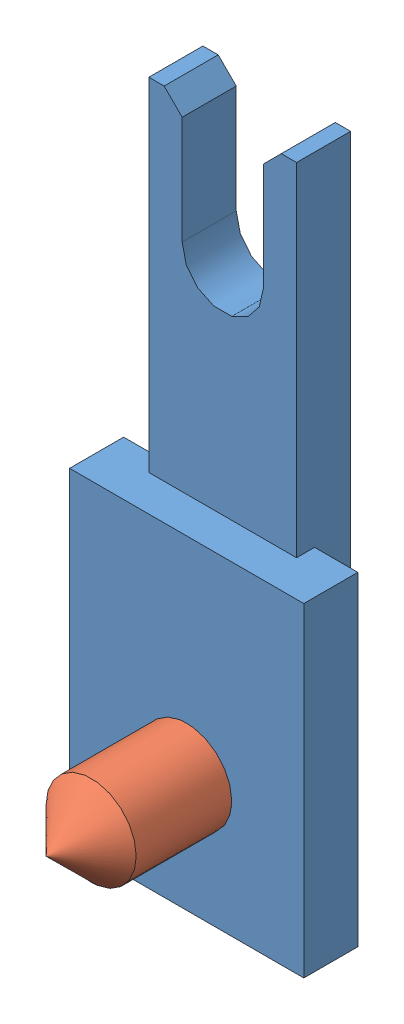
SolidWorks assembly 21.1715 LOCK 8 FOR DOOR LOCK.SLDASM, configuration Default (file format 3800). Lengths in mm.
Overall size (13 37 12.8).
2 component instances, 2 part files, 2 mates.
Components (placement in the parent):
- 21.1715 LOCK 8 FOR DOOR LOCK-1: 21.1715 LOCK 8 FOR DOOR LOCK.SLDPRT [Default] at origin size (13 37 5)
- SET SCREW M5X12 POINTED END DIN 914-1: SET SCREW M5X12 POINTED END DIN 914.SLDPRT [Default] at (0 0 10.8) x (0 0 -1) z (1 0 0) size (12 5 5)
Mates (geometry in assembly coordinates):
- Coincident1: coincident: axis of ?; axis of 21.1715 LOCK 8 FOR DOOR LOCK-1
- Distance1: distance = 1.2 mm aligned: plane of 21.1715 LOCK 8 FOR DOOR LOCK-1 through (6.5 11.5 0) normal (0 0 -1); plane of SET SCREW M5X12 POINTED END DIN 914-1 through (0 0 -1.2) normal (0 0 -1)
